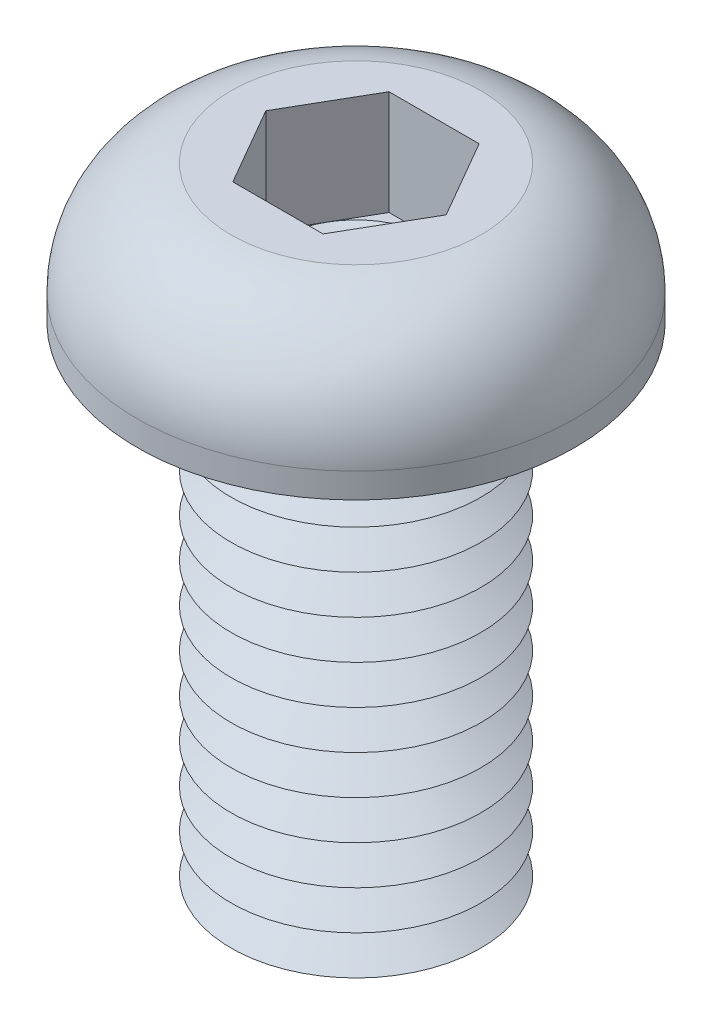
ISO-10303-21;
HEADER;
FILE_DESCRIPTION(('STEP AP214'),'2;1');
FILE_NAME('part.step','',(''),(''),'','','');
FILE_SCHEMA(('AUTOMOTIVE_DESIGN { 1 0 10303 214 1 1 1 1 }'));
ENDSEC;
DATA;
#1=APPLICATION_CONTEXT('core data for automotive mechanical design processes');
#2=APPLICATION_PROTOCOL_DEFINITION('international standard','automotive_design',2000,#1);
#3=PRODUCT_CONTEXT('',#1,'mechanical');
#4=PRODUCT('Part','Part','',(#3));
#5=PRODUCT_RELATED_PRODUCT_CATEGORY('part','',(#4));
#6=PRODUCT_DEFINITION_FORMATION('','',#4);
#7=PRODUCT_DEFINITION_CONTEXT('part definition',#1,'design');
#8=PRODUCT_DEFINITION('design','',#6,#7);
#9=PRODUCT_DEFINITION_SHAPE('','',#8);
#10=(LENGTH_UNIT() NAMED_UNIT(*) SI_UNIT(.MILLI.,.METRE.));
#11=(NAMED_UNIT(*) PLANE_ANGLE_UNIT() SI_UNIT($,.RADIAN.));
#12=(NAMED_UNIT(*) SI_UNIT($,.STERADIAN.) SOLID_ANGLE_UNIT());
#13=UNCERTAINTY_MEASURE_WITH_UNIT(LENGTH_MEASURE(1.E-05),#10,'distance_accuracy_value','');
#14=(GEOMETRIC_REPRESENTATION_CONTEXT(3) GLOBAL_UNCERTAINTY_ASSIGNED_CONTEXT((#13)) GLOBAL_UNIT_ASSIGNED_CONTEXT((#10,
#11,#12)) REPRESENTATION_CONTEXT('',''));
#15=CARTESIAN_POINT('',(0.,0.,0.));
#16=DIRECTION('',(0.,0.,1.));
#17=DIRECTION('',(1.,0.,0.));
#18=AXIS2_PLACEMENT_3D('',#15,#16,#17);
#19=CARTESIAN_POINT('',(0.,0.,0.));
#20=DIRECTION('',(0.,-1.,0.));
#21=DIRECTION('',(0.,0.,-1.));
#22=AXIS2_PLACEMENT_3D('',#19,#20,#21);
#23=TOROIDAL_SURFACE('',#22,4.625,0.625);
#24=CARTESIAN_POINT('',(0.,0.,-5.25));
#25=VERTEX_POINT('',#24);
#26=VERTEX_LOOP('',#25);
#27=FACE_BOUND('',#26,.T.);
#28=ADVANCED_FACE('P0_F12',(#27),#23,.T.);
#29=CLOSED_SHELL('',(#28));
#30=MANIFOLD_SOLID_BREP('P0_B1',#29);
#31=CARTESIAN_POINT('',(1.44337567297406,1.05,-2.5));
#32=DIRECTION('',(0.,1.,0.));
#33=DIRECTION('',(0.,0.,1.));
#34=AXIS2_PLACEMENT_3D('',#31,#32,#33);
#35=PLANE('',#34);
#36=CARTESIAN_POINT('',(0.,1.05,0.));
#37=DIRECTION('',(0.,1.,0.));
#38=DIRECTION('',(0.,0.,1.));
#39=AXIS2_PLACEMENT_3D('',#36,#37,#38);
#40=CIRCLE('',#39,2.5);
#41=CARTESIAN_POINT('',(0.,1.05,2.5));
#42=VERTEX_POINT('',#41);
#43=CARTESIAN_POINT('',(2.1650635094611,1.05,1.25));
#44=VERTEX_POINT('',#43);
#45=EDGE_CURVE('P1_E93',#42,#44,#40,.T.);
#46=ORIENTED_EDGE('',*,*,#45,.F.);
#47=DIRECTION('',(1.,0.,0.));
#48=VECTOR('',#47,1.);
#49=CARTESIAN_POINT('',(-1.44337567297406,1.05,2.5));
#50=LINE('',#49,#48);
#51=CARTESIAN_POINT('',(1.44337567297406,1.05,2.5));
#52=VERTEX_POINT('',#51);
#53=EDGE_CURVE('P1_E116',#42,#52,#50,.T.);
#54=ORIENTED_EDGE('',*,*,#53,.T.);
#55=DIRECTION('',(0.5,0.,-0.866025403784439));
#56=VECTOR('',#55,1.);
#57=CARTESIAN_POINT('',(1.44337567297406,1.05,2.5));
#58=LINE('',#57,#56);
#59=EDGE_CURVE('P1_E112',#52,#44,#58,.T.);
#60=ORIENTED_EDGE('',*,*,#59,.T.);
#61=EDGE_LOOP('',(#46,#54,#60));
#62=FACE_BOUND('',#61,.T.);
#63=ADVANCED_FACE('P1_F15',(#62),#35,.T.);
#64=CARTESIAN_POINT('',(0.,1.05,0.));
#65=DIRECTION('',(0.,1.,0.));
#66=DIRECTION('',(0.,0.,1.));
#67=AXIS2_PLACEMENT_3D('',#64,#65,#66);
#68=CIRCLE('',#67,2.5);
#69=CARTESIAN_POINT('',(2.1650635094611,1.05,-1.25));
#70=VERTEX_POINT('',#69);
#71=EDGE_CURVE('P1_E10',#44,#70,#68,.T.);
#72=ORIENTED_EDGE('',*,*,#71,.F.);
#73=CARTESIAN_POINT('',(2.88675134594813,1.05,0.));
#74=VERTEX_POINT('',#73);
#75=EDGE_CURVE('P1_E104',#44,#74,#58,.T.);
#76=ORIENTED_EDGE('',*,*,#75,.T.);
#77=DIRECTION('',(-0.5,0.,-0.866025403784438));
#78=VECTOR('',#77,1.);
#79=CARTESIAN_POINT('',(2.88675134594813,1.05,0.));
#80=LINE('',#79,#78);
#81=EDGE_CURVE('P1_E107',#74,#70,#80,.T.);
#82=ORIENTED_EDGE('',*,*,#81,.T.);
#83=EDGE_LOOP('',(#72,#76,#82));
#84=FACE_BOUND('',#83,.T.);
#85=ADVANCED_FACE('P1_F103',(#84),#35,.T.);
#86=CARTESIAN_POINT('',(0.,1.05,-2.5));
#87=VERTEX_POINT('',#86);
#88=EDGE_CURVE('P1_E24',#70,#87,#68,.T.);
#89=ORIENTED_EDGE('',*,*,#88,.F.);
#90=CARTESIAN_POINT('',(1.44337567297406,1.05,-2.5));
#91=VERTEX_POINT('',#90);
#92=EDGE_CURVE('P1_E139',#70,#91,#80,.T.);
#93=ORIENTED_EDGE('',*,*,#92,.T.);
#94=DIRECTION('',(-1.,0.,0.));
#95=VECTOR('',#94,1.);
#96=CARTESIAN_POINT('',(1.44337567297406,1.05,-2.5));
#97=LINE('',#96,#95);
#98=EDGE_CURVE('P1_E294',#91,#87,#97,.T.);
#99=ORIENTED_EDGE('',*,*,#98,.T.);
#100=EDGE_LOOP('',(#89,#93,#99));
#101=FACE_BOUND('',#100,.T.);
#102=ADVANCED_FACE('P1_F259',(#101),#35,.T.);
#103=CARTESIAN_POINT('',(-2.1650635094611,1.05,-1.25));
#104=VERTEX_POINT('',#103);
#105=EDGE_CURVE('P1_E289',#87,#104,#68,.T.);
#106=ORIENTED_EDGE('',*,*,#105,.F.);
#107=CARTESIAN_POINT('',(-1.44337567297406,1.05,-2.5));
#108=VERTEX_POINT('',#107);
#109=EDGE_CURVE('P1_E298',#87,#108,#97,.T.);
#110=ORIENTED_EDGE('',*,*,#109,.T.);
#111=DIRECTION('',(-0.5,0.,0.866025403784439));
#112=VECTOR('',#111,1.);
#113=CARTESIAN_POINT('',(-1.44337567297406,1.05,-2.5));
#114=LINE('',#113,#112);
#115=EDGE_CURVE('P1_E293',#108,#104,#114,.T.);
#116=ORIENTED_EDGE('',*,*,#115,.T.);
#117=EDGE_LOOP('',(#106,#110,#116));
#118=FACE_BOUND('',#117,.T.);
#119=ADVANCED_FACE('P1_F273',(#118),#35,.T.);
#120=CARTESIAN_POINT('',(-2.1650635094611,1.05,1.25));
#121=VERTEX_POINT('',#120);
#122=EDGE_CURVE('P1_E31',#104,#121,#68,.T.);
#123=ORIENTED_EDGE('',*,*,#122,.F.);
#124=CARTESIAN_POINT('',(-2.88675134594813,1.05,0.));
#125=VERTEX_POINT('',#124);
#126=EDGE_CURVE('P1_E285',#104,#125,#114,.T.);
#127=ORIENTED_EDGE('',*,*,#126,.T.);
#128=DIRECTION('',(0.5,0.,0.866025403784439));
#129=VECTOR('',#128,1.);
#130=CARTESIAN_POINT('',(-2.88675134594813,1.05,0.));
#131=LINE('',#130,#129);
#132=EDGE_CURVE('P1_E288',#125,#121,#131,.T.);
#133=ORIENTED_EDGE('',*,*,#132,.T.);
#134=EDGE_LOOP('',(#123,#127,#133));
#135=FACE_BOUND('',#134,.T.);
#136=ADVANCED_FACE('P1_F264',(#135),#35,.T.);
#137=CARTESIAN_POINT('',(0.,-14.75,0.));
#138=DIRECTION('',(0.,1.,0.));
#139=DIRECTION('',(0.,0.,1.));
#140=AXIS2_PLACEMENT_3D('',#137,#138,#139);
#141=CONICAL_SURFACE('',#140,2.91746824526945,1.0471975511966);
#142=CARTESIAN_POINT('',(0.,-14.125,0.));
#143=DIRECTION('',(0.,-1.,0.));
#144=DIRECTION('',(0.,0.,-1.));
#145=AXIS2_PLACEMENT_3D('',#142,#143,#144);
#146=CIRCLE('',#145,4.);
#147=CARTESIAN_POINT('',(0.,-14.125,-4.));
#148=VERTEX_POINT('',#147);
#149=EDGE_CURVE('P1_E221',#148,#148,#146,.T.);
#150=ORIENTED_EDGE('',*,*,#149,.T.);
#151=EDGE_LOOP('',(#150));
#152=FACE_BOUND('',#151,.T.);
#153=CARTESIAN_POINT('',(0.,-14.75,0.));
#154=DIRECTION('',(0.,-1.,0.));
#155=DIRECTION('',(0.,0.,-1.));
#156=AXIS2_PLACEMENT_3D('',#153,#154,#155);
#157=CIRCLE('',#156,2.91746824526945);
#158=CARTESIAN_POINT('',(0.,-14.75,-2.91746824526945));
#159=VERTEX_POINT('',#158);
#160=EDGE_CURVE('P1_E224',#159,#159,#157,.T.);
#161=ORIENTED_EDGE('',*,*,#160,.F.);
#162=EDGE_LOOP('',(#161));
#163=FACE_BOUND('',#162,.T.);
#164=ADVANCED_FACE('P1_F272',(#152,#163),#141,.T.);
#165=CARTESIAN_POINT('',(0.,-15.375,0.));
#166=DIRECTION('',(0.,-1.,0.));
#167=DIRECTION('',(0.,0.,-1.));
#168=AXIS2_PLACEMENT_3D('',#165,#166,#167);
#169=CONICAL_SURFACE('',#168,4.,1.0471975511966);
#170=ORIENTED_EDGE('',*,*,#160,.T.);
#171=EDGE_LOOP('',(#170));
#172=FACE_BOUND('',#171,.T.);
#173=CARTESIAN_POINT('',(0.,-15.375,0.));
#174=DIRECTION('',(0.,-1.,0.));
#175=DIRECTION('',(0.,0.,-1.));
#176=AXIS2_PLACEMENT_3D('',#173,#174,#175);
#177=CIRCLE('',#176,4.);
#178=CARTESIAN_POINT('',(0.,-15.375,-4.));
#179=VERTEX_POINT('',#178);
#180=EDGE_CURVE('P1_E227',#179,#179,#177,.T.);
#181=ORIENTED_EDGE('',*,*,#180,.F.);
#182=EDGE_LOOP('',(#181));
#183=FACE_BOUND('',#182,.T.);
#184=ADVANCED_FACE('P1_F279',(#172,#183),#169,.T.);
#185=CARTESIAN_POINT('',(0.,-16.,0.));
#186=DIRECTION('',(0.,1.,0.));
#187=DIRECTION('',(0.,0.,1.));
#188=AXIS2_PLACEMENT_3D('',#185,#186,#187);
#189=PLANE('',#188);
#190=CARTESIAN_POINT('',(0.,-16.,0.));
#191=DIRECTION('',(0.,-1.,0.));
#192=DIRECTION('',(0.,0.,-1.));
#193=AXIS2_PLACEMENT_3D('',#190,#191,#192);
#194=CIRCLE('',#193,2.91746824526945);
#195=CARTESIAN_POINT('',(0.,-16.,-2.91746824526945));
#196=VERTEX_POINT('',#195);
#197=EDGE_CURVE('P1_E230',#196,#196,#194,.T.);
#198=ORIENTED_EDGE('',*,*,#197,.T.);
#199=EDGE_LOOP('',(#198));
#200=FACE_BOUND('',#199,.T.);
#201=ADVANCED_FACE('P1_F357',(#200),#189,.F.);
#202=CARTESIAN_POINT('',(0.,-16.,0.));
#203=DIRECTION('',(0.,1.,0.));
#204=DIRECTION('',(0.,0.,1.));
#205=AXIS2_PLACEMENT_3D('',#202,#203,#204);
#206=CONICAL_SURFACE('',#205,2.91746824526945,1.0471975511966);
#207=ORIENTED_EDGE('',*,*,#180,.T.);
#208=EDGE_LOOP('',(#207));
#209=FACE_BOUND('',#208,.T.);
#210=ORIENTED_EDGE('',*,*,#197,.F.);
#211=EDGE_LOOP('',(#210));
#212=FACE_BOUND('',#211,.T.);
#213=ADVANCED_FACE('P1_F368',(#209,#212),#206,.T.);
#214=CARTESIAN_POINT('',(0.,-13.5,0.));
#215=DIRECTION('',(0.,1.,0.));
#216=DIRECTION('',(0.,0.,1.));
#217=AXIS2_PLACEMENT_3D('',#214,#215,#216);
#218=CONICAL_SURFACE('',#217,2.91746824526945,1.0471975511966);
#219=CARTESIAN_POINT('',(0.,-12.875,0.));
#220=DIRECTION('',(0.,-1.,0.));
#221=DIRECTION('',(0.,0.,-1.));
#222=AXIS2_PLACEMENT_3D('',#219,#220,#221);
#223=CIRCLE('',#222,4.);
#224=CARTESIAN_POINT('',(0.,-12.875,-4.));
#225=VERTEX_POINT('',#224);
#226=EDGE_CURVE('P1_E215',#225,#225,#223,.T.);
#227=ORIENTED_EDGE('',*,*,#226,.T.);
#228=EDGE_LOOP('',(#227));
#229=FACE_BOUND('',#228,.T.);
#230=CARTESIAN_POINT('',(0.,-13.5,0.));
#231=DIRECTION('',(0.,-1.,0.));
#232=DIRECTION('',(0.,0.,-1.));
#233=AXIS2_PLACEMENT_3D('',#230,#231,#232);
#234=CIRCLE('',#233,2.91746824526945);
#235=CARTESIAN_POINT('',(0.,-13.5,-2.91746824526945));
#236=VERTEX_POINT('',#235);
#237=EDGE_CURVE('P1_E218',#236,#236,#234,.T.);
#238=ORIENTED_EDGE('',*,*,#237,.F.);
#239=EDGE_LOOP('',(#238));
#240=FACE_BOUND('',#239,.T.);
#241=ADVANCED_FACE('P1_F377',(#229,#240),#218,.T.);
#242=CARTESIAN_POINT('',(0.,-14.125,0.));
#243=DIRECTION('',(0.,-1.,0.));
#244=DIRECTION('',(0.,0.,-1.));
#245=AXIS2_PLACEMENT_3D('',#242,#243,#244);
#246=CONICAL_SURFACE('',#245,4.,1.0471975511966);
#247=ORIENTED_EDGE('',*,*,#237,.T.);
#248=EDGE_LOOP('',(#247));
#249=FACE_BOUND('',#248,.T.);
#250=ORIENTED_EDGE('',*,*,#149,.F.);
#251=EDGE_LOOP('',(#250));
#252=FACE_BOUND('',#251,.T.);
#253=ADVANCED_FACE('P1_F386',(#249,#252),#246,.T.);
#254=CARTESIAN_POINT('',(0.,-12.25,0.));
#255=DIRECTION('',(0.,1.,0.));
#256=DIRECTION('',(0.,0.,1.));
#257=AXIS2_PLACEMENT_3D('',#254,#255,#256);
#258=CONICAL_SURFACE('',#257,2.91746824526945,1.0471975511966);
#259=CARTESIAN_POINT('',(0.,-11.625,0.));
#260=DIRECTION('',(0.,-1.,0.));
#261=DIRECTION('',(0.,0.,-1.));
#262=AXIS2_PLACEMENT_3D('',#259,#260,#261);
#263=CIRCLE('',#262,4.);
#264=CARTESIAN_POINT('',(0.,-11.625,-4.));
#265=VERTEX_POINT('',#264);
#266=EDGE_CURVE('P1_E209',#265,#265,#263,.T.);
#267=ORIENTED_EDGE('',*,*,#266,.T.);
#268=EDGE_LOOP('',(#267));
#269=FACE_BOUND('',#268,.T.);
#270=CARTESIAN_POINT('',(0.,-12.25,0.));
#271=DIRECTION('',(0.,-1.,0.));
#272=DIRECTION('',(0.,0.,-1.));
#273=AXIS2_PLACEMENT_3D('',#270,#271,#272);
#274=CIRCLE('',#273,2.91746824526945);
#275=CARTESIAN_POINT('',(0.,-12.25,-2.91746824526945));
#276=VERTEX_POINT('',#275);
#277=EDGE_CURVE('P1_E212',#276,#276,#274,.T.);
#278=ORIENTED_EDGE('',*,*,#277,.F.);
#279=EDGE_LOOP('',(#278));
#280=FACE_BOUND('',#279,.T.);
#281=ADVANCED_FACE('P1_F396',(#269,#280),#258,.T.);
#282=CARTESIAN_POINT('',(0.,-12.875,0.));
#283=DIRECTION('',(0.,-1.,0.));
#284=DIRECTION('',(0.,0.,-1.));
#285=AXIS2_PLACEMENT_3D('',#282,#283,#284);
#286=CONICAL_SURFACE('',#285,4.,1.0471975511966);
#287=ORIENTED_EDGE('',*,*,#277,.T.);
#288=EDGE_LOOP('',(#287));
#289=FACE_BOUND('',#288,.T.);
#290=ORIENTED_EDGE('',*,*,#226,.F.);
#291=EDGE_LOOP('',(#290));
#292=FACE_BOUND('',#291,.T.);
#293=ADVANCED_FACE('P1_F406',(#289,#292),#286,.T.);
#294=CARTESIAN_POINT('',(0.,-11.,0.));
#295=DIRECTION('',(0.,1.,0.));
#296=DIRECTION('',(0.,0.,1.));
#297=AXIS2_PLACEMENT_3D('',#294,#295,#296);
#298=CONICAL_SURFACE('',#297,2.91746824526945,1.0471975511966);
#299=CARTESIAN_POINT('',(0.,-10.375,0.));
#300=DIRECTION('',(0.,-1.,0.));
#301=DIRECTION('',(0.,0.,-1.));
#302=AXIS2_PLACEMENT_3D('',#299,#300,#301);
#303=CIRCLE('',#302,4.);
#304=CARTESIAN_POINT('',(0.,-10.375,-4.));
#305=VERTEX_POINT('',#304);
#306=EDGE_CURVE('P1_E203',#305,#305,#303,.T.);
#307=ORIENTED_EDGE('',*,*,#306,.T.);
#308=EDGE_LOOP('',(#307));
#309=FACE_BOUND('',#308,.T.);
#310=CARTESIAN_POINT('',(0.,-11.,0.));
#311=DIRECTION('',(0.,-1.,0.));
#312=DIRECTION('',(0.,0.,-1.));
#313=AXIS2_PLACEMENT_3D('',#310,#311,#312);
#314=CIRCLE('',#313,2.91746824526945);
#315=CARTESIAN_POINT('',(0.,-11.,-2.91746824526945));
#316=VERTEX_POINT('',#315);
#317=EDGE_CURVE('P1_E206',#316,#316,#314,.T.);
#318=ORIENTED_EDGE('',*,*,#317,.F.);
#319=EDGE_LOOP('',(#318));
#320=FACE_BOUND('',#319,.T.);
#321=ADVANCED_FACE('P1_F416',(#309,#320),#298,.T.);
#322=CARTESIAN_POINT('',(0.,-11.625,0.));
#323=DIRECTION('',(0.,-1.,0.));
#324=DIRECTION('',(0.,0.,-1.));
#325=AXIS2_PLACEMENT_3D('',#322,#323,#324);
#326=CONICAL_SURFACE('',#325,4.,1.0471975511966);
#327=ORIENTED_EDGE('',*,*,#317,.T.);
#328=EDGE_LOOP('',(#327));
#329=FACE_BOUND('',#328,.T.);
#330=ORIENTED_EDGE('',*,*,#266,.F.);
#331=EDGE_LOOP('',(#330));
#332=FACE_BOUND('',#331,.T.);
#333=ADVANCED_FACE('P1_F426',(#329,#332),#326,.T.);
#334=CARTESIAN_POINT('',(0.,-9.75,0.));
#335=DIRECTION('',(0.,1.,0.));
#336=DIRECTION('',(0.,0.,1.));
#337=AXIS2_PLACEMENT_3D('',#334,#335,#336);
#338=CONICAL_SURFACE('',#337,2.91746824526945,1.0471975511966);
#339=CARTESIAN_POINT('',(0.,-9.125,0.));
#340=DIRECTION('',(0.,-1.,0.));
#341=DIRECTION('',(0.,0.,-1.));
#342=AXIS2_PLACEMENT_3D('',#339,#340,#341);
#343=CIRCLE('',#342,4.);
#344=CARTESIAN_POINT('',(0.,-9.125,-4.));
#345=VERTEX_POINT('',#344);
#346=EDGE_CURVE('P1_E197',#345,#345,#343,.T.);
#347=ORIENTED_EDGE('',*,*,#346,.T.);
#348=EDGE_LOOP('',(#347));
#349=FACE_BOUND('',#348,.T.);
#350=CARTESIAN_POINT('',(0.,-9.75,0.));
#351=DIRECTION('',(0.,-1.,0.));
#352=DIRECTION('',(0.,0.,-1.));
#353=AXIS2_PLACEMENT_3D('',#350,#351,#352);
#354=CIRCLE('',#353,2.91746824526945);
#355=CARTESIAN_POINT('',(0.,-9.75,-2.91746824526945));
#356=VERTEX_POINT('',#355);
#357=EDGE_CURVE('P1_E200',#356,#356,#354,.T.);
#358=ORIENTED_EDGE('',*,*,#357,.F.);
#359=EDGE_LOOP('',(#358));
#360=FACE_BOUND('',#359,.T.);
#361=ADVANCED_FACE('P1_F436',(#349,#360),#338,.T.);
#362=CARTESIAN_POINT('',(0.,-10.375,0.));
#363=DIRECTION('',(0.,-1.,0.));
#364=DIRECTION('',(0.,0.,-1.));
#365=AXIS2_PLACEMENT_3D('',#362,#363,#364);
#366=CONICAL_SURFACE('',#365,4.,1.0471975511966);
#367=ORIENTED_EDGE('',*,*,#357,.T.);
#368=EDGE_LOOP('',(#367));
#369=FACE_BOUND('',#368,.T.);
#370=ORIENTED_EDGE('',*,*,#306,.F.);
#371=EDGE_LOOP('',(#370));
#372=FACE_BOUND('',#371,.T.);
#373=ADVANCED_FACE('P1_F446',(#369,#372),#366,.T.);
#374=CARTESIAN_POINT('',(0.,-8.5,0.));
#375=DIRECTION('',(0.,1.,0.));
#376=DIRECTION('',(0.,0.,1.));
#377=AXIS2_PLACEMENT_3D('',#374,#375,#376);
#378=CONICAL_SURFACE('',#377,2.91746824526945,1.0471975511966);
#379=CARTESIAN_POINT('',(0.,-7.875,0.));
#380=DIRECTION('',(0.,-1.,0.));
#381=DIRECTION('',(0.,0.,-1.));
#382=AXIS2_PLACEMENT_3D('',#379,#380,#381);
#383=CIRCLE('',#382,4.);
#384=CARTESIAN_POINT('',(0.,-7.875,-4.));
#385=VERTEX_POINT('',#384);
#386=EDGE_CURVE('P1_E191',#385,#385,#383,.T.);
#387=ORIENTED_EDGE('',*,*,#386,.T.);
#388=EDGE_LOOP('',(#387));
#389=FACE_BOUND('',#388,.T.);
#390=CARTESIAN_POINT('',(0.,-8.5,0.));
#391=DIRECTION('',(0.,-1.,0.));
#392=DIRECTION('',(0.,0.,-1.));
#393=AXIS2_PLACEMENT_3D('',#390,#391,#392);
#394=CIRCLE('',#393,2.91746824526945);
#395=CARTESIAN_POINT('',(0.,-8.5,-2.91746824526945));
#396=VERTEX_POINT('',#395);
#397=EDGE_CURVE('P1_E194',#396,#396,#394,.T.);
#398=ORIENTED_EDGE('',*,*,#397,.F.);
#399=EDGE_LOOP('',(#398));
#400=FACE_BOUND('',#399,.T.);
#401=ADVANCED_FACE('P1_F456',(#389,#400),#378,.T.);
#402=CARTESIAN_POINT('',(0.,-9.125,0.));
#403=DIRECTION('',(0.,-1.,0.));
#404=DIRECTION('',(0.,0.,-1.));
#405=AXIS2_PLACEMENT_3D('',#402,#403,#404);
#406=CONICAL_SURFACE('',#405,4.,1.0471975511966);
#407=ORIENTED_EDGE('',*,*,#397,.T.);
#408=EDGE_LOOP('',(#407));
#409=FACE_BOUND('',#408,.T.);
#410=ORIENTED_EDGE('',*,*,#346,.F.);
#411=EDGE_LOOP('',(#410));
#412=FACE_BOUND('',#411,.T.);
#413=ADVANCED_FACE('P1_F466',(#409,#412),#406,.T.);
#414=CARTESIAN_POINT('',(0.,-7.25,0.));
#415=DIRECTION('',(0.,1.,0.));
#416=DIRECTION('',(0.,0.,1.));
#417=AXIS2_PLACEMENT_3D('',#414,#415,#416);
#418=CONICAL_SURFACE('',#417,2.91746824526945,1.0471975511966);
#419=CARTESIAN_POINT('',(0.,-6.625,0.));
#420=DIRECTION('',(0.,-1.,0.));
#421=DIRECTION('',(0.,0.,-1.));
#422=AXIS2_PLACEMENT_3D('',#419,#420,#421);
#423=CIRCLE('',#422,4.);
#424=CARTESIAN_POINT('',(0.,-6.625,-4.));
#425=VERTEX_POINT('',#424);
#426=EDGE_CURVE('P1_E185',#425,#425,#423,.T.);
#427=ORIENTED_EDGE('',*,*,#426,.T.);
#428=EDGE_LOOP('',(#427));
#429=FACE_BOUND('',#428,.T.);
#430=CARTESIAN_POINT('',(0.,-7.25,0.));
#431=DIRECTION('',(0.,-1.,0.));
#432=DIRECTION('',(0.,0.,-1.));
#433=AXIS2_PLACEMENT_3D('',#430,#431,#432);
#434=CIRCLE('',#433,2.91746824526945);
#435=CARTESIAN_POINT('',(0.,-7.25,-2.91746824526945));
#436=VERTEX_POINT('',#435);
#437=EDGE_CURVE('P1_E188',#436,#436,#434,.T.);
#438=ORIENTED_EDGE('',*,*,#437,.F.);
#439=EDGE_LOOP('',(#438));
#440=FACE_BOUND('',#439,.T.);
#441=ADVANCED_FACE('P1_F476',(#429,#440),#418,.T.);
#442=CARTESIAN_POINT('',(0.,-7.875,0.));
#443=DIRECTION('',(0.,-1.,0.));
#444=DIRECTION('',(0.,0.,-1.));
#445=AXIS2_PLACEMENT_3D('',#442,#443,#444);
#446=CONICAL_SURFACE('',#445,4.,1.0471975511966);
#447=ORIENTED_EDGE('',*,*,#437,.T.);
#448=EDGE_LOOP('',(#447));
#449=FACE_BOUND('',#448,.T.);
#450=ORIENTED_EDGE('',*,*,#386,.F.);
#451=EDGE_LOOP('',(#450));
#452=FACE_BOUND('',#451,.T.);
#453=ADVANCED_FACE('P1_F486',(#449,#452),#446,.T.);
#454=CARTESIAN_POINT('',(0.,-6.,0.));
#455=DIRECTION('',(0.,1.,0.));
#456=DIRECTION('',(0.,0.,1.));
#457=AXIS2_PLACEMENT_3D('',#454,#455,#456);
#458=CONICAL_SURFACE('',#457,2.91746824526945,1.0471975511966);
#459=CARTESIAN_POINT('',(0.,-5.375,0.));
#460=DIRECTION('',(0.,-1.,0.));
#461=DIRECTION('',(0.,0.,-1.));
#462=AXIS2_PLACEMENT_3D('',#459,#460,#461);
#463=CIRCLE('',#462,4.);
#464=CARTESIAN_POINT('',(0.,-5.375,-4.));
#465=VERTEX_POINT('',#464);
#466=EDGE_CURVE('P1_E179',#465,#465,#463,.T.);
#467=ORIENTED_EDGE('',*,*,#466,.T.);
#468=EDGE_LOOP('',(#467));
#469=FACE_BOUND('',#468,.T.);
#470=CARTESIAN_POINT('',(0.,-6.,0.));
#471=DIRECTION('',(0.,-1.,0.));
#472=DIRECTION('',(0.,0.,-1.));
#473=AXIS2_PLACEMENT_3D('',#470,#471,#472);
#474=CIRCLE('',#473,2.91746824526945);
#475=CARTESIAN_POINT('',(0.,-6.,-2.91746824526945));
#476=VERTEX_POINT('',#475);
#477=EDGE_CURVE('P1_E182',#476,#476,#474,.T.);
#478=ORIENTED_EDGE('',*,*,#477,.F.);
#479=EDGE_LOOP('',(#478));
#480=FACE_BOUND('',#479,.T.);
#481=ADVANCED_FACE('P1_F496',(#469,#480),#458,.T.);
#482=CARTESIAN_POINT('',(0.,-6.625,0.));
#483=DIRECTION('',(0.,-1.,0.));
#484=DIRECTION('',(0.,0.,-1.));
#485=AXIS2_PLACEMENT_3D('',#482,#483,#484);
#486=CONICAL_SURFACE('',#485,4.,1.0471975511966);
#487=ORIENTED_EDGE('',*,*,#477,.T.);
#488=EDGE_LOOP('',(#487));
#489=FACE_BOUND('',#488,.T.);
#490=ORIENTED_EDGE('',*,*,#426,.F.);
#491=EDGE_LOOP('',(#490));
#492=FACE_BOUND('',#491,.T.);
#493=ADVANCED_FACE('P1_F506',(#489,#492),#486,.T.);
#494=CARTESIAN_POINT('',(0.,-4.75,0.));
#495=DIRECTION('',(0.,1.,0.));
#496=DIRECTION('',(0.,0.,1.));
#497=AXIS2_PLACEMENT_3D('',#494,#495,#496);
#498=CONICAL_SURFACE('',#497,2.91746824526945,1.0471975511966);
#499=CARTESIAN_POINT('',(0.,-4.125,0.));
#500=DIRECTION('',(0.,-1.,0.));
#501=DIRECTION('',(0.,0.,-1.));
#502=AXIS2_PLACEMENT_3D('',#499,#500,#501);
#503=CIRCLE('',#502,4.);
#504=CARTESIAN_POINT('',(0.,-4.125,-4.));
#505=VERTEX_POINT('',#504);
#506=EDGE_CURVE('P1_E173',#505,#505,#503,.T.);
#507=ORIENTED_EDGE('',*,*,#506,.T.);
#508=EDGE_LOOP('',(#507));
#509=FACE_BOUND('',#508,.T.);
#510=CARTESIAN_POINT('',(0.,-4.75,0.));
#511=DIRECTION('',(0.,-1.,0.));
#512=DIRECTION('',(0.,0.,-1.));
#513=AXIS2_PLACEMENT_3D('',#510,#511,#512);
#514=CIRCLE('',#513,2.91746824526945);
#515=CARTESIAN_POINT('',(0.,-4.75,-2.91746824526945));
#516=VERTEX_POINT('',#515);
#517=EDGE_CURVE('P1_E176',#516,#516,#514,.T.);
#518=ORIENTED_EDGE('',*,*,#517,.F.);
#519=EDGE_LOOP('',(#518));
#520=FACE_BOUND('',#519,.T.);
#521=ADVANCED_FACE('P1_F516',(#509,#520),#498,.T.);
#522=CARTESIAN_POINT('',(0.,-5.375,0.));
#523=DIRECTION('',(0.,-1.,0.));
#524=DIRECTION('',(0.,0.,-1.));
#525=AXIS2_PLACEMENT_3D('',#522,#523,#524);
#526=CONICAL_SURFACE('',#525,4.,1.0471975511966);
#527=ORIENTED_EDGE('',*,*,#517,.T.);
#528=EDGE_LOOP('',(#527));
#529=FACE_BOUND('',#528,.T.);
#530=ORIENTED_EDGE('',*,*,#466,.F.);
#531=EDGE_LOOP('',(#530));
#532=FACE_BOUND('',#531,.T.);
#533=ADVANCED_FACE('P1_F526',(#529,#532),#526,.T.);
#534=CARTESIAN_POINT('',(0.,-3.5,0.));
#535=DIRECTION('',(0.,1.,0.));
#536=DIRECTION('',(0.,0.,1.));
#537=AXIS2_PLACEMENT_3D('',#534,#535,#536);
#538=CONICAL_SURFACE('',#537,2.91746824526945,1.0471975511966);
#539=CARTESIAN_POINT('',(0.,-2.875,0.));
#540=DIRECTION('',(0.,-1.,0.));
#541=DIRECTION('',(0.,0.,-1.));
#542=AXIS2_PLACEMENT_3D('',#539,#540,#541);
#543=CIRCLE('',#542,4.);
#544=CARTESIAN_POINT('',(0.,-2.875,-4.));
#545=VERTEX_POINT('',#544);
#546=EDGE_CURVE('P1_E164',#545,#545,#543,.T.);
#547=ORIENTED_EDGE('',*,*,#546,.T.);
#548=EDGE_LOOP('',(#547));
#549=FACE_BOUND('',#548,.T.);
#550=CARTESIAN_POINT('',(0.,-3.5,0.));
#551=DIRECTION('',(0.,-1.,0.));
#552=DIRECTION('',(0.,0.,-1.));
#553=AXIS2_PLACEMENT_3D('',#550,#551,#552);
#554=CIRCLE('',#553,2.91746824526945);
#555=CARTESIAN_POINT('',(0.,-3.5,-2.91746824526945));
#556=VERTEX_POINT('',#555);
#557=EDGE_CURVE('P1_E170',#556,#556,#554,.T.);
#558=ORIENTED_EDGE('',*,*,#557,.F.);
#559=EDGE_LOOP('',(#558));
#560=FACE_BOUND('',#559,.T.);
#561=ADVANCED_FACE('P1_F536',(#549,#560),#538,.T.);
#562=CARTESIAN_POINT('',(0.,-4.125,0.));
#563=DIRECTION('',(0.,-1.,0.));
#564=DIRECTION('',(0.,0.,-1.));
#565=AXIS2_PLACEMENT_3D('',#562,#563,#564);
#566=CONICAL_SURFACE('',#565,4.,1.0471975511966);
#567=ORIENTED_EDGE('',*,*,#557,.T.);
#568=EDGE_LOOP('',(#567));
#569=FACE_BOUND('',#568,.T.);
#570=ORIENTED_EDGE('',*,*,#506,.F.);
#571=EDGE_LOOP('',(#570));
#572=FACE_BOUND('',#571,.T.);
#573=ADVANCED_FACE('P1_F546',(#569,#572),#566,.T.);
#574=CARTESIAN_POINT('',(0.,-2.25,0.));
#575=DIRECTION('',(0.,1.,0.));
#576=DIRECTION('',(0.,0.,1.));
#577=AXIS2_PLACEMENT_3D('',#574,#575,#576);
#578=CONICAL_SURFACE('',#577,2.91746824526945,1.0471975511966);
#579=CARTESIAN_POINT('',(0.,-1.625,0.));
#580=DIRECTION('',(0.,-1.,0.));
#581=DIRECTION('',(0.,0.,-1.));
#582=AXIS2_PLACEMENT_3D('',#579,#580,#581);
#583=CIRCLE('',#582,4.);
#584=CARTESIAN_POINT('',(0.,-1.625,-4.));
#585=VERTEX_POINT('',#584);
#586=EDGE_CURVE('P1_E167',#585,#585,#583,.T.);
#587=ORIENTED_EDGE('',*,*,#586,.T.);
#588=EDGE_LOOP('',(#587));
#589=FACE_BOUND('',#588,.T.);
#590=CARTESIAN_POINT('',(0.,-2.25,0.));
#591=DIRECTION('',(0.,-1.,0.));
#592=DIRECTION('',(0.,0.,-1.));
#593=AXIS2_PLACEMENT_3D('',#590,#591,#592);
#594=CIRCLE('',#593,2.91746824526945);
#595=CARTESIAN_POINT('',(0.,-2.25,-2.91746824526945));
#596=VERTEX_POINT('',#595);
#597=EDGE_CURVE('P1_E161',#596,#596,#594,.T.);
#598=ORIENTED_EDGE('',*,*,#597,.F.);
#599=EDGE_LOOP('',(#598));
#600=FACE_BOUND('',#599,.T.);
#601=ADVANCED_FACE('P1_F556',(#589,#600),#578,.T.);
#602=CARTESIAN_POINT('',(0.,-2.875,0.));
#603=DIRECTION('',(0.,-1.,0.));
#604=DIRECTION('',(0.,0.,-1.));
#605=AXIS2_PLACEMENT_3D('',#602,#603,#604);
#606=CONICAL_SURFACE('',#605,4.,1.0471975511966);
#607=ORIENTED_EDGE('',*,*,#597,.T.);
#608=EDGE_LOOP('',(#607));
#609=FACE_BOUND('',#608,.T.);
#610=ORIENTED_EDGE('',*,*,#546,.F.);
#611=EDGE_LOOP('',(#610));
#612=FACE_BOUND('',#611,.T.);
#613=ADVANCED_FACE('P1_F566',(#609,#612),#606,.T.);
#614=CARTESIAN_POINT('',(0.,-16.,0.));
#615=DIRECTION('',(0.,1.,0.));
#616=DIRECTION('',(0.,0.,1.));
#617=AXIS2_PLACEMENT_3D('',#614,#615,#616);
#618=CYLINDRICAL_SURFACE('',#617,4.);
#619=CARTESIAN_POINT('',(0.,0.,0.));
#620=DIRECTION('',(0.,-1.,0.));
#621=DIRECTION('',(1.,0.,0.));
#622=AXIS2_PLACEMENT_3D('',#619,#620,#621);
#623=CIRCLE('',#622,4.);
#624=CARTESIAN_POINT('',(4.,0.,0.));
#625=VERTEX_POINT('',#624);
#626=EDGE_CURVE('P1_E141',#625,#625,#623,.F.);
#627=ORIENTED_EDGE('',*,*,#626,.F.);
#628=EDGE_LOOP('',(#627));
#629=FACE_BOUND('',#628,.T.);
#630=ORIENTED_EDGE('',*,*,#586,.F.);
#631=EDGE_LOOP('',(#630));
#632=FACE_BOUND('',#631,.T.);
#633=ADVANCED_FACE('P1_F17',(#629,#632),#618,.T.);
#634=CARTESIAN_POINT('',(0.,0.,0.));
#635=DIRECTION('',(0.,-1.,0.));
#636=DIRECTION('',(0.,0.,-1.));
#637=AXIS2_PLACEMENT_3D('',#634,#635,#636);
#638=TOROIDAL_SURFACE('',#637,4.625,0.625);
#639=ORIENTED_EDGE('',*,*,#626,.T.);
#640=EDGE_LOOP('',(#639));
#641=FACE_BOUND('',#640,.T.);
#642=CARTESIAN_POINT('',(0.,0.,0.));
#643=DIRECTION('',(0.,1.,0.));
#644=DIRECTION('',(-1.,0.,0.));
#645=AXIS2_PLACEMENT_3D('',#642,#643,#644);
#646=CIRCLE('',#645,5.25);
#647=CARTESIAN_POINT('',(-5.25,0.,0.));
#648=VERTEX_POINT('',#647);
#649=EDGE_CURVE('P1_E151',#648,#648,#646,.F.);
#650=ORIENTED_EDGE('',*,*,#649,.T.);
#651=EDGE_LOOP('',(#650));
#652=FACE_BOUND('',#651,.T.);
#653=ADVANCED_FACE('P1_F235',(#641,#652),#638,.F.);
#654=CARTESIAN_POINT('',(4.,4.4,0.));
#655=DIRECTION('',(0.,-1.,0.));
#656=DIRECTION('',(1.,0.,0.));
#657=AXIS2_PLACEMENT_3D('',#654,#655,#656);
#658=PLANE('',#657);
#659=DIRECTION('',(-1.,0.,0.));
#660=VECTOR('',#659,1.);
#661=CARTESIAN_POINT('',(1.44337567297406,4.4,-2.5));
#662=LINE('',#661,#660);
#663=CARTESIAN_POINT('',(1.44337567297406,4.4,-2.5));
#664=VERTEX_POINT('',#663);
#665=CARTESIAN_POINT('',(-1.44337567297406,4.4,-2.5));
#666=VERTEX_POINT('',#665);
#667=EDGE_CURVE('P1_E125',#664,#666,#662,.T.);
#668=ORIENTED_EDGE('',*,*,#667,.F.);
#669=DIRECTION('',(-0.5,0.,-0.866025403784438));
#670=VECTOR('',#669,1.);
#671=CARTESIAN_POINT('',(2.88675134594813,4.4,0.));
#672=LINE('',#671,#670);
#673=CARTESIAN_POINT('',(2.88675134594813,4.4,0.));
#674=VERTEX_POINT('',#673);
#675=EDGE_CURVE('P1_E39',#674,#664,#672,.T.);
#676=ORIENTED_EDGE('',*,*,#675,.F.);
#677=DIRECTION('',(0.5,0.,-0.866025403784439));
#678=VECTOR('',#677,1.);
#679=CARTESIAN_POINT('',(1.44337567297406,4.4,2.5));
#680=LINE('',#679,#678);
#681=CARTESIAN_POINT('',(1.44337567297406,4.4,2.5));
#682=VERTEX_POINT('',#681);
#683=EDGE_CURVE('P1_E137',#682,#674,#680,.T.);
#684=ORIENTED_EDGE('',*,*,#683,.F.);
#685=DIRECTION('',(1.,0.,0.));
#686=VECTOR('',#685,1.);
#687=CARTESIAN_POINT('',(-1.44337567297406,4.4,2.5));
#688=LINE('',#687,#686);
#689=CARTESIAN_POINT('',(-1.44337567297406,4.4,2.5));
#690=VERTEX_POINT('',#689);
#691=EDGE_CURVE('P1_E134',#690,#682,#688,.T.);
#692=ORIENTED_EDGE('',*,*,#691,.F.);
#693=DIRECTION('',(0.5,0.,0.866025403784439));
#694=VECTOR('',#693,1.);
#695=CARTESIAN_POINT('',(-2.88675134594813,4.4,0.));
#696=LINE('',#695,#694);
#697=CARTESIAN_POINT('',(-2.88675134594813,4.4,0.));
#698=VERTEX_POINT('',#697);
#699=EDGE_CURVE('P1_E131',#698,#690,#696,.T.);
#700=ORIENTED_EDGE('',*,*,#699,.F.);
#701=DIRECTION('',(-0.5,0.,0.866025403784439));
#702=VECTOR('',#701,1.);
#703=CARTESIAN_POINT('',(-1.44337567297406,4.4,-2.5));
#704=LINE('',#703,#702);
#705=EDGE_CURVE('P1_E128',#666,#698,#704,.T.);
#706=ORIENTED_EDGE('',*,*,#705,.F.);
#707=EDGE_LOOP('',(#668,#676,#684,#692,#700,#706));
#708=FACE_BOUND('',#707,.T.);
#709=CARTESIAN_POINT('',(0.,4.4,0.));
#710=DIRECTION('',(0.,1.,0.));
#711=DIRECTION('',(-1.,0.,0.));
#712=AXIS2_PLACEMENT_3D('',#709,#710,#711);
#713=CIRCLE('',#712,4.);
#714=CARTESIAN_POINT('',(-4.,4.4,0.));
#715=VERTEX_POINT('',#714);
#716=EDGE_CURVE('P1_E152',#715,#715,#713,.T.);
#717=ORIENTED_EDGE('',*,*,#716,.T.);
#718=EDGE_LOOP('',(#717));
#719=FACE_BOUND('',#718,.T.);
#720=ADVANCED_FACE('P1_F313',(#708,#719),#658,.F.);
#721=CARTESIAN_POINT('',(0.,0.8,0.));
#722=DIRECTION('',(0.,1.,0.));
#723=DIRECTION('',(-1.,0.,0.));
#724=AXIS2_PLACEMENT_3D('',#721,#722,#723);
#725=DEGENERATE_TOROIDAL_SURFACE('',#724,3.34,3.66,.T.);
#726=ORIENTED_EDGE('',*,*,#716,.F.);
#727=EDGE_LOOP('',(#726));
#728=FACE_BOUND('',#727,.T.);
#729=CARTESIAN_POINT('',(0.,0.799999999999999,0.));
#730=DIRECTION('',(0.,1.,0.));
#731=DIRECTION('',(-1.,0.,0.));
#732=AXIS2_PLACEMENT_3D('',#729,#730,#731);
#733=CIRCLE('',#732,7.);
#734=CARTESIAN_POINT('',(-7.,0.799999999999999,0.));
#735=VERTEX_POINT('',#734);
#736=EDGE_CURVE('P1_E155',#735,#735,#733,.T.);
#737=ORIENTED_EDGE('',*,*,#736,.T.);
#738=EDGE_LOOP('',(#737));
#739=FACE_BOUND('',#738,.T.);
#740=ADVANCED_FACE('P1_F249',(#728,#739),#725,.T.);
#741=CARTESIAN_POINT('',(0.,4.4,0.));
#742=DIRECTION('',(0.,1.,0.));
#743=DIRECTION('',(-1.,0.,0.));
#744=AXIS2_PLACEMENT_3D('',#741,#742,#743);
#745=CYLINDRICAL_SURFACE('',#744,7.);
#746=ORIENTED_EDGE('',*,*,#736,.F.);
#747=EDGE_LOOP('',(#746));
#748=FACE_BOUND('',#747,.T.);
#749=CARTESIAN_POINT('',(0.,0.,0.));
#750=DIRECTION('',(0.,1.,0.));
#751=DIRECTION('',(-1.,0.,0.));
#752=AXIS2_PLACEMENT_3D('',#749,#750,#751);
#753=CIRCLE('',#752,7.);
#754=CARTESIAN_POINT('',(-7.,0.,0.));
#755=VERTEX_POINT('',#754);
#756=EDGE_CURVE('P1_E158',#755,#755,#753,.T.);
#757=ORIENTED_EDGE('',*,*,#756,.T.);
#758=EDGE_LOOP('',(#757));
#759=FACE_BOUND('',#758,.T.);
#760=ADVANCED_FACE('P1_F240',(#748,#759),#745,.T.);
#761=CARTESIAN_POINT('',(0.,0.,0.));
#762=DIRECTION('',(0.,1.,0.));
#763=DIRECTION('',(-1.,0.,0.));
#764=AXIS2_PLACEMENT_3D('',#761,#762,#763);
#765=PLANE('',#764);
#766=ORIENTED_EDGE('',*,*,#756,.F.);
#767=EDGE_LOOP('',(#766));
#768=FACE_BOUND('',#767,.T.);
#769=ORIENTED_EDGE('',*,*,#649,.F.);
#770=EDGE_LOOP('',(#769));
#771=FACE_BOUND('',#770,.T.);
#772=ADVANCED_FACE('P1_F237',(#768,#771),#765,.F.);
#773=CARTESIAN_POINT('',(2.88675134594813,1.05,0.));
#774=DIRECTION('',(0.866025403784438,0.,-0.5));
#775=DIRECTION('',(-0.5,0.,-0.866025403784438));
#776=AXIS2_PLACEMENT_3D('',#773,#774,#775);
#777=PLANE('',#776);
#778=ORIENTED_EDGE('',*,*,#675,.T.);
#779=DIRECTION('',(0.,1.,0.));
#780=VECTOR('',#779,1.);
#781=CARTESIAN_POINT('',(1.44337567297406,1.05,-2.5));
#782=LINE('',#781,#780);
#783=EDGE_CURVE('P1_E118',#91,#664,#782,.T.);
#784=ORIENTED_EDGE('',*,*,#783,.F.);
#785=ORIENTED_EDGE('',*,*,#92,.F.);
#786=ORIENTED_EDGE('',*,*,#81,.F.);
#787=DIRECTION('',(0.,1.,0.));
#788=VECTOR('',#787,1.);
#789=CARTESIAN_POINT('',(2.88675134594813,1.05,0.));
#790=LINE('',#789,#788);
#791=EDGE_CURVE('P1_E113',#74,#674,#790,.T.);
#792=ORIENTED_EDGE('',*,*,#791,.T.);
#793=EDGE_LOOP('',(#778,#784,#785,#786,#792));
#794=FACE_BOUND('',#793,.T.);
#795=ADVANCED_FACE('P1_F239',(#794),#777,.F.);
#796=CARTESIAN_POINT('',(1.44337567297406,1.05,2.5));
#797=DIRECTION('',(0.866025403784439,0.,0.5));
#798=DIRECTION('',(0.5,0.,-0.866025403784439));
#799=AXIS2_PLACEMENT_3D('',#796,#797,#798);
#800=PLANE('',#799);
#801=ORIENTED_EDGE('',*,*,#683,.T.);
#802=ORIENTED_EDGE('',*,*,#791,.F.);
#803=ORIENTED_EDGE('',*,*,#75,.F.);
#804=ORIENTED_EDGE('',*,*,#59,.F.);
#805=DIRECTION('',(0.,1.,0.));
#806=VECTOR('',#805,1.);
#807=CARTESIAN_POINT('',(1.44337567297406,1.05,2.5));
#808=LINE('',#807,#806);
#809=EDGE_CURVE('P1_E142',#52,#682,#808,.T.);
#810=ORIENTED_EDGE('',*,*,#809,.T.);
#811=EDGE_LOOP('',(#801,#802,#803,#804,#810));
#812=FACE_BOUND('',#811,.T.);
#813=ADVANCED_FACE('P1_F111',(#812),#800,.F.);
#814=CARTESIAN_POINT('',(-1.44337567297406,1.05,2.5));
#815=DIRECTION('',(0.,0.,1.));
#816=DIRECTION('',(1.,0.,0.));
#817=AXIS2_PLACEMENT_3D('',#814,#815,#816);
#818=PLANE('',#817);
#819=ORIENTED_EDGE('',*,*,#691,.T.);
#820=ORIENTED_EDGE('',*,*,#809,.F.);
#821=ORIENTED_EDGE('',*,*,#53,.F.);
#822=CARTESIAN_POINT('',(-1.44337567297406,1.05,2.5));
#823=VERTEX_POINT('',#822);
#824=EDGE_CURVE('P1_E114',#823,#42,#50,.T.);
#825=ORIENTED_EDGE('',*,*,#824,.F.);
#826=DIRECTION('',(0.,1.,0.));
#827=VECTOR('',#826,1.);
#828=CARTESIAN_POINT('',(-1.44337567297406,1.05,2.5));
#829=LINE('',#828,#827);
#830=EDGE_CURVE('P1_E144',#823,#690,#829,.T.);
#831=ORIENTED_EDGE('',*,*,#830,.T.);
#832=EDGE_LOOP('',(#819,#820,#821,#825,#831));
#833=FACE_BOUND('',#832,.T.);
#834=ADVANCED_FACE('P1_F308',(#833),#818,.F.);
#835=CARTESIAN_POINT('',(-2.88675134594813,1.05,0.));
#836=DIRECTION('',(-0.866025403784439,0.,0.5));
#837=DIRECTION('',(0.5,0.,0.866025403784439));
#838=AXIS2_PLACEMENT_3D('',#835,#836,#837);
#839=PLANE('',#838);
#840=ORIENTED_EDGE('',*,*,#699,.T.);
#841=ORIENTED_EDGE('',*,*,#830,.F.);
#842=EDGE_CURVE('P1_E300',#121,#823,#131,.T.);
#843=ORIENTED_EDGE('',*,*,#842,.F.);
#844=ORIENTED_EDGE('',*,*,#132,.F.);
#845=DIRECTION('',(0.,1.,0.));
#846=VECTOR('',#845,1.);
#847=CARTESIAN_POINT('',(-2.88675134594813,1.05,0.));
#848=LINE('',#847,#846);
#849=EDGE_CURVE('P1_E146',#125,#698,#848,.T.);
#850=ORIENTED_EDGE('',*,*,#849,.T.);
#851=EDGE_LOOP('',(#840,#841,#843,#844,#850));
#852=FACE_BOUND('',#851,.T.);
#853=ADVANCED_FACE('P1_F644',(#852),#839,.F.);
#854=CARTESIAN_POINT('',(-1.44337567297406,1.05,-2.5));
#855=DIRECTION('',(-0.866025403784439,0.,-0.5));
#856=DIRECTION('',(-0.5,0.,0.866025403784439));
#857=AXIS2_PLACEMENT_3D('',#854,#855,#856);
#858=PLANE('',#857);
#859=ORIENTED_EDGE('',*,*,#705,.T.);
#860=ORIENTED_EDGE('',*,*,#849,.F.);
#861=ORIENTED_EDGE('',*,*,#126,.F.);
#862=ORIENTED_EDGE('',*,*,#115,.F.);
#863=DIRECTION('',(0.,1.,0.));
#864=VECTOR('',#863,1.);
#865=CARTESIAN_POINT('',(-1.44337567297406,1.05,-2.5));
#866=LINE('',#865,#864);
#867=EDGE_CURVE('P1_E119',#108,#666,#866,.T.);
#868=ORIENTED_EDGE('',*,*,#867,.T.);
#869=EDGE_LOOP('',(#859,#860,#861,#862,#868));
#870=FACE_BOUND('',#869,.T.);
#871=ADVANCED_FACE('P1_F268',(#870),#858,.F.);
#872=CARTESIAN_POINT('',(1.44337567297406,1.05,-2.5));
#873=DIRECTION('',(0.,0.,-1.));
#874=DIRECTION('',(-1.,0.,0.));
#875=AXIS2_PLACEMENT_3D('',#872,#873,#874);
#876=PLANE('',#875);
#877=ORIENTED_EDGE('',*,*,#667,.T.);
#878=ORIENTED_EDGE('',*,*,#867,.F.);
#879=ORIENTED_EDGE('',*,*,#109,.F.);
#880=ORIENTED_EDGE('',*,*,#98,.F.);
#881=ORIENTED_EDGE('',*,*,#783,.T.);
#882=EDGE_LOOP('',(#877,#878,#879,#880,#881));
#883=FACE_BOUND('',#882,.T.);
#884=ADVANCED_FACE('P1_F262',(#883),#876,.F.);
#885=EDGE_CURVE('P1_E19',#121,#42,#68,.T.);
#886=ORIENTED_EDGE('',*,*,#885,.F.);
#887=ORIENTED_EDGE('',*,*,#842,.T.);
#888=ORIENTED_EDGE('',*,*,#824,.T.);
#889=EDGE_LOOP('',(#886,#887,#888));
#890=FACE_BOUND('',#889,.T.);
#891=ADVANCED_FACE('P1_F90',(#890),#35,.T.);
#892=CARTESIAN_POINT('',(0.,1.05,0.));
#893=DIRECTION('',(0.,1.,0.));
#894=DIRECTION('',(0.,0.,1.));
#895=AXIS2_PLACEMENT_3D('',#892,#893,#894);
#896=CONICAL_SURFACE('',#895,2.5,1.0471975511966);
#897=CARTESIAN_POINT('',(0.,-0.393375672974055,0.));
#898=VERTEX_POINT('',#897);
#899=VERTEX_LOOP('',#898);
#900=FACE_BOUND('',#899,.T.);
#901=ORIENTED_EDGE('',*,*,#45,.T.);
#902=ORIENTED_EDGE('',*,*,#71,.T.);
#903=ORIENTED_EDGE('',*,*,#88,.T.);
#904=ORIENTED_EDGE('',*,*,#105,.T.);
#905=ORIENTED_EDGE('',*,*,#122,.T.);
#906=ORIENTED_EDGE('',*,*,#885,.T.);
#907=EDGE_LOOP('',(#901,#902,#903,#904,#905,#906));
#908=FACE_BOUND('',#907,.T.);
#909=ADVANCED_FACE('P1_F88',(#900,#908),#896,.F.);
#910=CLOSED_SHELL('',(#63,#85,#102,#119,#136,#164,#184,#201,#213,#241,#253,#281,#293,#321,#333,
#361,#373,#401,#413,#441,#453,#481,#493,#521,#533,#561,#573,#601,#613,#633,#653,#720,#740,#760,
#772,#795,#813,#834,#853,#871,#884,#891,#909));
#911=MANIFOLD_SOLID_BREP('P1_B1',#910);
#912=ADVANCED_BREP_SHAPE_REPRESENTATION('',(#18,#30,#911),#14);
#913=SHAPE_DEFINITION_REPRESENTATION(#9,#912);
ENDSEC;
END-ISO-10303-21;
